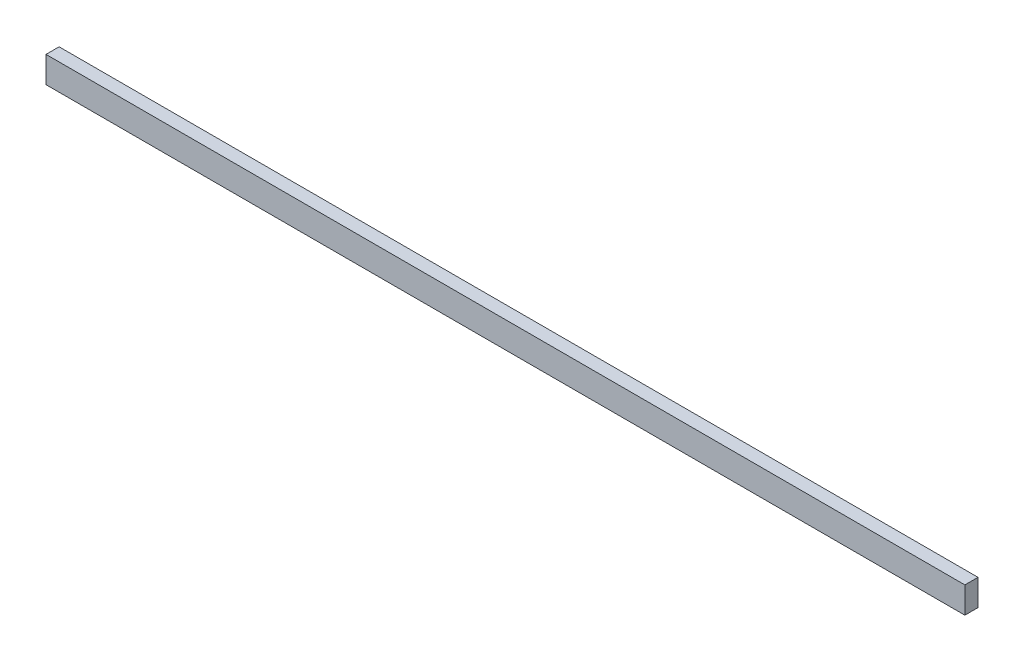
ISO-10303-21;
HEADER;
FILE_DESCRIPTION(('STEP AP214'),'2;1');
FILE_NAME('part.step','',(''),(''),'','','');
FILE_SCHEMA(('AUTOMOTIVE_DESIGN { 1 0 10303 214 1 1 1 1 }'));
ENDSEC;
DATA;
#1=APPLICATION_CONTEXT('core data for automotive mechanical design processes');
#2=APPLICATION_PROTOCOL_DEFINITION('international standard','automotive_design',2000,#1);
#3=PRODUCT_CONTEXT('',#1,'mechanical');
#4=PRODUCT('Part','Part','',(#3));
#5=PRODUCT_RELATED_PRODUCT_CATEGORY('part','',(#4));
#6=PRODUCT_DEFINITION_FORMATION('','',#4);
#7=PRODUCT_DEFINITION_CONTEXT('part definition',#1,'design');
#8=PRODUCT_DEFINITION('design','',#6,#7);
#9=PRODUCT_DEFINITION_SHAPE('','',#8);
#10=(LENGTH_UNIT() NAMED_UNIT(*) SI_UNIT(.MILLI.,.METRE.));
#11=(NAMED_UNIT(*) PLANE_ANGLE_UNIT() SI_UNIT($,.RADIAN.));
#12=(NAMED_UNIT(*) SI_UNIT($,.STERADIAN.) SOLID_ANGLE_UNIT());
#13=UNCERTAINTY_MEASURE_WITH_UNIT(LENGTH_MEASURE(1.E-05),#10,'distance_accuracy_value','');
#14=(GEOMETRIC_REPRESENTATION_CONTEXT(3) GLOBAL_UNCERTAINTY_ASSIGNED_CONTEXT((#13)) GLOBAL_UNIT_ASSIGNED_CONTEXT((#10,
#11,#12)) REPRESENTATION_CONTEXT('',''));
#15=CARTESIAN_POINT('',(0.,0.,0.));
#16=DIRECTION('',(0.,0.,1.));
#17=DIRECTION('',(1.,0.,0.));
#18=AXIS2_PLACEMENT_3D('',#15,#16,#17);
#19=CARTESIAN_POINT('',(0.,0.,5.));
#20=DIRECTION('',(1.,0.,0.));
#21=DIRECTION('',(0.,0.,-1.));
#22=AXIS2_PLACEMENT_3D('',#19,#20,#21);
#23=PLANE('',#22);
#24=DIRECTION('',(0.,-1.,0.));
#25=VECTOR('',#24,1.);
#26=CARTESIAN_POINT('',(0.,0.,0.));
#27=LINE('',#26,#25);
#28=CARTESIAN_POINT('',(0.,10.,0.));
#29=VERTEX_POINT('',#28);
#30=CARTESIAN_POINT('',(0.,0.,0.));
#31=VERTEX_POINT('',#30);
#32=EDGE_CURVE('E70',#29,#31,#27,.T.);
#33=ORIENTED_EDGE('',*,*,#32,.T.);
#34=DIRECTION('',(0.,0.,-1.));
#35=VECTOR('',#34,1.);
#36=CARTESIAN_POINT('',(0.,0.,5.));
#37=LINE('',#36,#35);
#38=CARTESIAN_POINT('',(0.,0.,5.));
#39=VERTEX_POINT('',#38);
#40=EDGE_CURVE('E11',#39,#31,#37,.T.);
#41=ORIENTED_EDGE('',*,*,#40,.F.);
#42=DIRECTION('',(0.,-1.,0.));
#43=VECTOR('',#42,1.);
#44=CARTESIAN_POINT('',(0.,0.,5.));
#45=LINE('',#44,#43);
#46=CARTESIAN_POINT('',(0.,10.,5.));
#47=VERTEX_POINT('',#46);
#48=EDGE_CURVE('E88',#47,#39,#45,.T.);
#49=ORIENTED_EDGE('',*,*,#48,.F.);
#50=DIRECTION('',(0.,0.,-1.));
#51=VECTOR('',#50,1.);
#52=CARTESIAN_POINT('',(0.,10.,5.));
#53=LINE('',#52,#51);
#54=EDGE_CURVE('E82',#47,#29,#53,.T.);
#55=ORIENTED_EDGE('',*,*,#54,.T.);
#56=EDGE_LOOP('',(#33,#41,#49,#55));
#57=FACE_BOUND('',#56,.T.);
#58=ADVANCED_FACE('F26',(#57),#23,.F.);
#59=CARTESIAN_POINT('',(0.,0.,5.));
#60=DIRECTION('',(0.,1.,0.));
#61=DIRECTION('',(0.,0.,1.));
#62=AXIS2_PLACEMENT_3D('',#59,#60,#61);
#63=PLANE('',#62);
#64=DIRECTION('',(1.,0.,0.));
#65=VECTOR('',#64,1.);
#66=CARTESIAN_POINT('',(0.,0.,0.));
#67=LINE('',#66,#65);
#68=CARTESIAN_POINT('',(350.,0.,0.));
#69=VERTEX_POINT('',#68);
#70=EDGE_CURVE('E66',#31,#69,#67,.T.);
#71=ORIENTED_EDGE('',*,*,#70,.T.);
#72=DIRECTION('',(0.,0.,-1.));
#73=VECTOR('',#72,1.);
#74=CARTESIAN_POINT('',(350.,0.,5.));
#75=LINE('',#74,#73);
#76=CARTESIAN_POINT('',(350.,0.,5.));
#77=VERTEX_POINT('',#76);
#78=EDGE_CURVE('E33',#77,#69,#75,.T.);
#79=ORIENTED_EDGE('',*,*,#78,.F.);
#80=DIRECTION('',(1.,0.,0.));
#81=VECTOR('',#80,1.);
#82=CARTESIAN_POINT('',(0.,0.,5.));
#83=LINE('',#82,#81);
#84=EDGE_CURVE('E78',#39,#77,#83,.T.);
#85=ORIENTED_EDGE('',*,*,#84,.F.);
#86=ORIENTED_EDGE('',*,*,#40,.T.);
#87=EDGE_LOOP('',(#71,#79,#85,#86));
#88=FACE_BOUND('',#87,.T.);
#89=ADVANCED_FACE('F77',(#88),#63,.F.);
#90=CARTESIAN_POINT('',(350.,0.,5.));
#91=DIRECTION('',(-1.,0.,0.));
#92=DIRECTION('',(0.,0.,1.));
#93=AXIS2_PLACEMENT_3D('',#90,#91,#92);
#94=PLANE('',#93);
#95=DIRECTION('',(0.,1.,0.));
#96=VECTOR('',#95,1.);
#97=CARTESIAN_POINT('',(350.,0.,0.));
#98=LINE('',#97,#96);
#99=CARTESIAN_POINT('',(350.,10.,0.));
#100=VERTEX_POINT('',#99);
#101=EDGE_CURVE('E71',#69,#100,#98,.T.);
#102=ORIENTED_EDGE('',*,*,#101,.T.);
#103=DIRECTION('',(0.,0.,-1.));
#104=VECTOR('',#103,1.);
#105=CARTESIAN_POINT('',(350.,10.,5.));
#106=LINE('',#105,#104);
#107=CARTESIAN_POINT('',(350.,10.,5.));
#108=VERTEX_POINT('',#107);
#109=EDGE_CURVE('E94',#108,#100,#106,.T.);
#110=ORIENTED_EDGE('',*,*,#109,.F.);
#111=DIRECTION('',(0.,1.,0.));
#112=VECTOR('',#111,1.);
#113=CARTESIAN_POINT('',(350.,0.,5.));
#114=LINE('',#113,#112);
#115=EDGE_CURVE('E45',#77,#108,#114,.T.);
#116=ORIENTED_EDGE('',*,*,#115,.F.);
#117=ORIENTED_EDGE('',*,*,#78,.T.);
#118=EDGE_LOOP('',(#102,#110,#116,#117));
#119=FACE_BOUND('',#118,.T.);
#120=ADVANCED_FACE('F97',(#119),#94,.F.);
#121=CARTESIAN_POINT('',(0.,10.,5.));
#122=DIRECTION('',(0.,-1.,0.));
#123=DIRECTION('',(0.,0.,-1.));
#124=AXIS2_PLACEMENT_3D('',#121,#122,#123);
#125=PLANE('',#124);
#126=DIRECTION('',(-1.,0.,0.));
#127=VECTOR('',#126,1.);
#128=CARTESIAN_POINT('',(0.,10.,0.));
#129=LINE('',#128,#127);
#130=EDGE_CURVE('E86',#100,#29,#129,.T.);
#131=ORIENTED_EDGE('',*,*,#130,.T.);
#132=ORIENTED_EDGE('',*,*,#54,.F.);
#133=DIRECTION('',(-1.,0.,0.));
#134=VECTOR('',#133,1.);
#135=CARTESIAN_POINT('',(0.,10.,5.));
#136=LINE('',#135,#134);
#137=EDGE_CURVE('E40',#108,#47,#136,.T.);
#138=ORIENTED_EDGE('',*,*,#137,.F.);
#139=ORIENTED_EDGE('',*,*,#109,.T.);
#140=EDGE_LOOP('',(#131,#132,#138,#139));
#141=FACE_BOUND('',#140,.T.);
#142=ADVANCED_FACE('F99',(#141),#125,.F.);
#143=CARTESIAN_POINT('',(0.,10.,5.));
#144=DIRECTION('',(0.,0.,-1.));
#145=DIRECTION('',(-1.,0.,0.));
#146=AXIS2_PLACEMENT_3D('',#143,#144,#145);
#147=PLANE('',#146);
#148=ORIENTED_EDGE('',*,*,#48,.T.);
#149=ORIENTED_EDGE('',*,*,#84,.T.);
#150=ORIENTED_EDGE('',*,*,#115,.T.);
#151=ORIENTED_EDGE('',*,*,#137,.T.);
#152=EDGE_LOOP('',(#148,#149,#150,#151));
#153=FACE_BOUND('',#152,.T.);
#154=ADVANCED_FACE('F100',(#153),#147,.F.);
#155=CARTESIAN_POINT('',(0.,10.,0.));
#156=DIRECTION('',(0.,0.,-1.));
#157=DIRECTION('',(-1.,0.,0.));
#158=AXIS2_PLACEMENT_3D('',#155,#156,#157);
#159=PLANE('',#158);
#160=ORIENTED_EDGE('',*,*,#32,.F.);
#161=ORIENTED_EDGE('',*,*,#130,.F.);
#162=ORIENTED_EDGE('',*,*,#101,.F.);
#163=ORIENTED_EDGE('',*,*,#70,.F.);
#164=EDGE_LOOP('',(#160,#161,#162,#163));
#165=FACE_BOUND('',#164,.T.);
#166=ADVANCED_FACE('F67',(#165),#159,.T.);
#167=CLOSED_SHELL('',(#58,#89,#120,#142,#154,#166));
#168=MANIFOLD_SOLID_BREP('B2',#167);
#169=ADVANCED_BREP_SHAPE_REPRESENTATION('',(#18,#168),#14);
#170=SHAPE_DEFINITION_REPRESENTATION(#9,#169);
ENDSEC;
END-ISO-10303-21;
